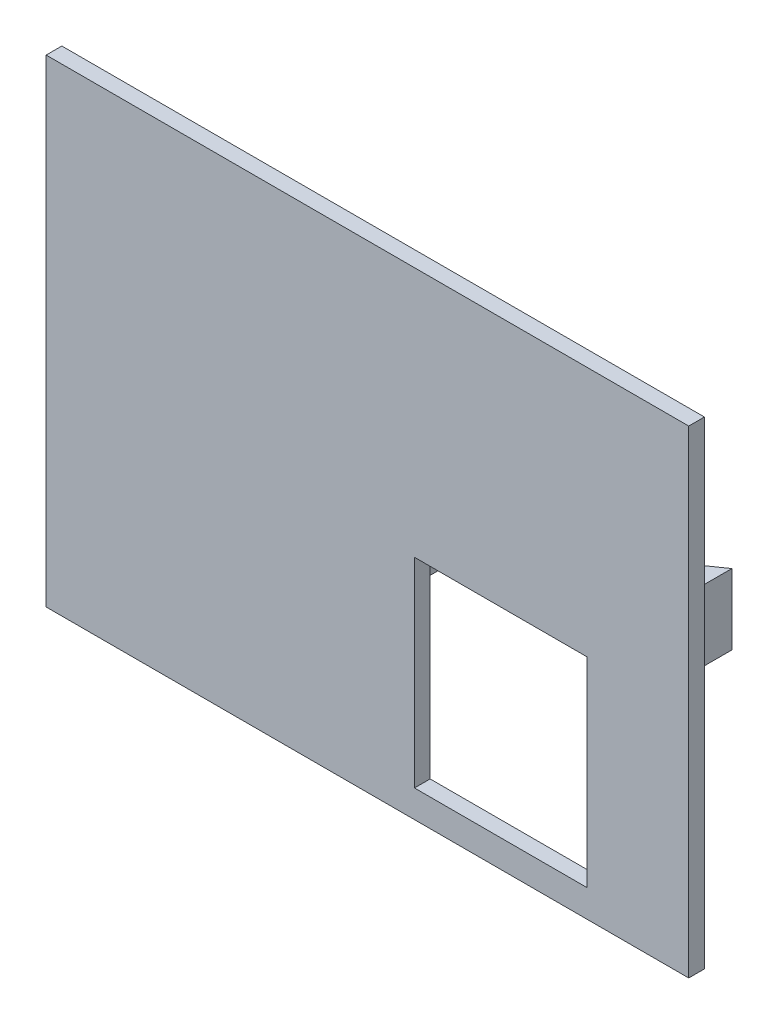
ISO-10303-21;
HEADER;
FILE_DESCRIPTION(('STEP AP214'),'2;1');
FILE_NAME('part.step','',(''),(''),'','','');
FILE_SCHEMA(('AUTOMOTIVE_DESIGN { 1 0 10303 214 1 1 1 1 }'));
ENDSEC;
DATA;
#1=APPLICATION_CONTEXT('core data for automotive mechanical design processes');
#2=APPLICATION_PROTOCOL_DEFINITION('international standard','automotive_design',2000,#1);
#3=PRODUCT_CONTEXT('',#1,'mechanical');
#4=PRODUCT('Part','Part','',(#3));
#5=PRODUCT_RELATED_PRODUCT_CATEGORY('part','',(#4));
#6=PRODUCT_DEFINITION_FORMATION('','',#4);
#7=PRODUCT_DEFINITION_CONTEXT('part definition',#1,'design');
#8=PRODUCT_DEFINITION('design','',#6,#7);
#9=PRODUCT_DEFINITION_SHAPE('','',#8);
#10=(LENGTH_UNIT() NAMED_UNIT(*) SI_UNIT(.MILLI.,.METRE.));
#11=(NAMED_UNIT(*) PLANE_ANGLE_UNIT() SI_UNIT($,.RADIAN.));
#12=(NAMED_UNIT(*) SI_UNIT($,.STERADIAN.) SOLID_ANGLE_UNIT());
#13=UNCERTAINTY_MEASURE_WITH_UNIT(LENGTH_MEASURE(1.E-05),#10,'distance_accuracy_value','');
#14=(GEOMETRIC_REPRESENTATION_CONTEXT(3) GLOBAL_UNCERTAINTY_ASSIGNED_CONTEXT((#13)) GLOBAL_UNIT_ASSIGNED_CONTEXT((#10,
#11,#12)) REPRESENTATION_CONTEXT('',''));
#15=CARTESIAN_POINT('',(0.,0.,0.));
#16=DIRECTION('',(0.,0.,1.));
#17=DIRECTION('',(1.,0.,0.));
#18=AXIS2_PLACEMENT_3D('',#15,#16,#17);
#19=CARTESIAN_POINT('',(-47.3837077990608,-22.5325375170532,0.));
#20=DIRECTION('',(0.,0.,1.));
#21=DIRECTION('',(1.,0.,0.));
#22=AXIS2_PLACEMENT_3D('',#19,#20,#21);
#23=PLANE('',#22);
#24=DIRECTION('',(1.,0.,0.));
#25=VECTOR('',#24,1.);
#26=CARTESIAN_POINT('',(-1.38370779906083,11.4674624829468,0.));
#27=LINE('',#26,#25);
#28=CARTESIAN_POINT('',(-2.88370779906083,11.4674624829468,0.));
#29=VERTEX_POINT('',#28);
#30=CARTESIAN_POINT('',(-1.38370779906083,11.4674624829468,0.));
#31=VERTEX_POINT('',#30);
#32=EDGE_CURVE('E240',#29,#31,#27,.T.);
#33=ORIENTED_EDGE('',*,*,#32,.F.);
#34=DIRECTION('',(0.,1.,0.));
#35=VECTOR('',#34,1.);
#36=CARTESIAN_POINT('',(-2.88370779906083,2.46746248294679,0.));
#37=LINE('',#36,#35);
#38=CARTESIAN_POINT('',(-2.88370779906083,2.46746248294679,0.));
#39=VERTEX_POINT('',#38);
#40=EDGE_CURVE('E234',#39,#29,#37,.T.);
#41=ORIENTED_EDGE('',*,*,#40,.F.);
#42=DIRECTION('',(-1.,0.,0.));
#43=VECTOR('',#42,1.);
#44=CARTESIAN_POINT('',(-1.38370779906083,2.46746248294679,0.));
#45=LINE('',#44,#43);
#46=CARTESIAN_POINT('',(-1.38370779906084,2.46746248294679,0.));
#47=VERTEX_POINT('',#46);
#48=EDGE_CURVE('E246',#47,#39,#45,.T.);
#49=ORIENTED_EDGE('',*,*,#48,.F.);
#50=DIRECTION('',(0.,-1.,0.));
#51=VECTOR('',#50,1.);
#52=CARTESIAN_POINT('',(-1.38370779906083,2.46746248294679,0.));
#53=LINE('',#52,#51);
#54=EDGE_CURVE('E242',#31,#47,#53,.T.);
#55=ORIENTED_EDGE('',*,*,#54,.F.);
#56=EDGE_LOOP('',(#33,#41,#49,#55));
#57=FACE_BOUND('',#56,.T.);
#58=DIRECTION('',(0.,-1.,0.));
#59=VECTOR('',#58,1.);
#60=CARTESIAN_POINT('',(21.6162922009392,-19.0325375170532,0.));
#61=LINE('',#60,#59);
#62=CARTESIAN_POINT('',(21.6162922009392,6.46746248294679,0.));
#63=VERTEX_POINT('',#62);
#64=CARTESIAN_POINT('',(21.6162922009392,-19.0325375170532,0.));
#65=VERTEX_POINT('',#64);
#66=EDGE_CURVE('E270',#63,#65,#61,.T.);
#67=ORIENTED_EDGE('',*,*,#66,.F.);
#68=DIRECTION('',(1.,0.,0.));
#69=VECTOR('',#68,1.);
#70=CARTESIAN_POINT('',(-0.383707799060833,6.46746248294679,0.));
#71=LINE('',#70,#69);
#72=CARTESIAN_POINT('',(-0.383707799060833,6.46746248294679,0.));
#73=VERTEX_POINT('',#72);
#74=EDGE_CURVE('E268',#73,#63,#71,.T.);
#75=ORIENTED_EDGE('',*,*,#74,.F.);
#76=DIRECTION('',(0.,1.,0.));
#77=VECTOR('',#76,1.);
#78=CARTESIAN_POINT('',(-0.383707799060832,-19.0325375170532,0.));
#79=LINE('',#78,#77);
#80=CARTESIAN_POINT('',(-0.383707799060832,-19.0325375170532,0.));
#81=VERTEX_POINT('',#80);
#82=EDGE_CURVE('E258',#81,#73,#79,.T.);
#83=ORIENTED_EDGE('',*,*,#82,.F.);
#84=DIRECTION('',(-1.,0.,0.));
#85=VECTOR('',#84,1.);
#86=CARTESIAN_POINT('',(-0.383707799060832,-19.0325375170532,0.));
#87=LINE('',#86,#85);
#88=EDGE_CURVE('E273',#65,#81,#87,.T.);
#89=ORIENTED_EDGE('',*,*,#88,.F.);
#90=EDGE_LOOP('',(#67,#75,#83,#89));
#91=FACE_BOUND('',#90,.T.);
#92=DIRECTION('',(0.,-1.,0.));
#93=VECTOR('',#92,1.);
#94=CARTESIAN_POINT('',(-47.3837077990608,38.4674624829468,0.));
#95=LINE('',#94,#93);
#96=CARTESIAN_POINT('',(-47.3837077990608,38.4674624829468,0.));
#97=VERTEX_POINT('',#96);
#98=CARTESIAN_POINT('',(-47.3837077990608,-22.5325375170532,0.));
#99=VERTEX_POINT('',#98);
#100=EDGE_CURVE('E280',#97,#99,#95,.T.);
#101=ORIENTED_EDGE('',*,*,#100,.F.);
#102=DIRECTION('',(-1.,0.,0.));
#103=VECTOR('',#102,1.);
#104=CARTESIAN_POINT('',(-47.3837077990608,38.4674624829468,0.));
#105=LINE('',#104,#103);
#106=CARTESIAN_POINT('',(34.6162922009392,38.4674624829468,0.));
#107=VERTEX_POINT('',#106);
#108=EDGE_CURVE('E291',#107,#97,#105,.T.);
#109=ORIENTED_EDGE('',*,*,#108,.F.);
#110=DIRECTION('',(0.,1.,0.));
#111=VECTOR('',#110,1.);
#112=CARTESIAN_POINT('',(34.6162922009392,38.4674624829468,0.));
#113=LINE('',#112,#111);
#114=CARTESIAN_POINT('',(34.6162922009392,-22.5325375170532,0.));
#115=VERTEX_POINT('',#114);
#116=EDGE_CURVE('E302',#115,#107,#113,.T.);
#117=ORIENTED_EDGE('',*,*,#116,.F.);
#118=DIRECTION('',(1.,0.,0.));
#119=VECTOR('',#118,1.);
#120=CARTESIAN_POINT('',(-47.3837077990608,-22.5325375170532,0.));
#121=LINE('',#120,#119);
#122=EDGE_CURVE('E300',#99,#115,#121,.T.);
#123=ORIENTED_EDGE('',*,*,#122,.F.);
#124=EDGE_LOOP('',(#101,#109,#117,#123));
#125=FACE_BOUND('',#124,.T.);
#126=DIRECTION('',(0.,1.,0.));
#127=VECTOR('',#126,1.);
#128=CARTESIAN_POINT('',(24.6162922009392,2.46746248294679,0.));
#129=LINE('',#128,#127);
#130=CARTESIAN_POINT('',(24.6162922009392,2.46746248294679,0.));
#131=VERTEX_POINT('',#130);
#132=CARTESIAN_POINT('',(24.6162922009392,11.4674624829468,0.));
#133=VERTEX_POINT('',#132);
#134=EDGE_CURVE('E195',#131,#133,#129,.T.);
#135=ORIENTED_EDGE('',*,*,#134,.F.);
#136=DIRECTION('',(-1.,0.,0.));
#137=VECTOR('',#136,1.);
#138=CARTESIAN_POINT('',(24.6162922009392,2.46746248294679,0.));
#139=LINE('',#138,#137);
#140=CARTESIAN_POINT('',(26.1162922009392,2.46746248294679,0.));
#141=VERTEX_POINT('',#140);
#142=EDGE_CURVE('E217',#141,#131,#139,.T.);
#143=ORIENTED_EDGE('',*,*,#142,.F.);
#144=DIRECTION('',(0.,-1.,0.));
#145=VECTOR('',#144,1.);
#146=CARTESIAN_POINT('',(26.1162922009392,2.46746248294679,0.));
#147=LINE('',#146,#145);
#148=CARTESIAN_POINT('',(26.1162922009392,11.4674624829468,0.));
#149=VERTEX_POINT('',#148);
#150=EDGE_CURVE('E54',#149,#141,#147,.T.);
#151=ORIENTED_EDGE('',*,*,#150,.F.);
#152=DIRECTION('',(1.,0.,0.));
#153=VECTOR('',#152,1.);
#154=CARTESIAN_POINT('',(24.6162922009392,11.4674624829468,0.));
#155=LINE('',#154,#153);
#156=EDGE_CURVE('E49',#133,#149,#155,.T.);
#157=ORIENTED_EDGE('',*,*,#156,.F.);
#158=EDGE_LOOP('',(#135,#143,#151,#157));
#159=FACE_BOUND('',#158,.T.);
#160=ADVANCED_FACE('F32',(#57,#91,#125,#159),#23,.F.);
#161=CARTESIAN_POINT('',(-47.3837077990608,38.4674624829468,2.));
#162=DIRECTION('',(1.,0.,0.));
#163=DIRECTION('',(0.,0.,-1.));
#164=AXIS2_PLACEMENT_3D('',#161,#162,#163);
#165=PLANE('',#164);
#166=ORIENTED_EDGE('',*,*,#100,.T.);
#167=DIRECTION('',(0.,0.,-1.));
#168=VECTOR('',#167,1.);
#169=CARTESIAN_POINT('',(-47.3837077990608,-22.5325375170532,2.));
#170=LINE('',#169,#168);
#171=CARTESIAN_POINT('',(-47.3837077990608,-22.5325375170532,2.));
#172=VERTEX_POINT('',#171);
#173=EDGE_CURVE('E11',#172,#99,#170,.T.);
#174=ORIENTED_EDGE('',*,*,#173,.F.);
#175=DIRECTION('',(0.,-1.,0.));
#176=VECTOR('',#175,1.);
#177=CARTESIAN_POINT('',(-47.3837077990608,38.4674624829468,2.));
#178=LINE('',#177,#176);
#179=CARTESIAN_POINT('',(-47.3837077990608,38.4674624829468,2.));
#180=VERTEX_POINT('',#179);
#181=EDGE_CURVE('E287',#180,#172,#178,.T.);
#182=ORIENTED_EDGE('',*,*,#181,.F.);
#183=DIRECTION('',(0.,0.,-1.));
#184=VECTOR('',#183,1.);
#185=CARTESIAN_POINT('',(-47.3837077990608,38.4674624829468,2.));
#186=LINE('',#185,#184);
#187=EDGE_CURVE('E297',#180,#97,#186,.T.);
#188=ORIENTED_EDGE('',*,*,#187,.T.);
#189=EDGE_LOOP('',(#166,#174,#182,#188));
#190=FACE_BOUND('',#189,.T.);
#191=ADVANCED_FACE('F34',(#190),#165,.F.);
#192=CARTESIAN_POINT('',(-47.3837077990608,-22.5325375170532,2.));
#193=DIRECTION('',(0.,1.,0.));
#194=DIRECTION('',(0.,0.,1.));
#195=AXIS2_PLACEMENT_3D('',#192,#193,#194);
#196=PLANE('',#195);
#197=ORIENTED_EDGE('',*,*,#122,.T.);
#198=DIRECTION('',(0.,0.,-1.));
#199=VECTOR('',#198,1.);
#200=CARTESIAN_POINT('',(34.6162922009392,-22.5325375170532,2.));
#201=LINE('',#200,#199);
#202=CARTESIAN_POINT('',(34.6162922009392,-22.5325375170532,2.));
#203=VERTEX_POINT('',#202);
#204=EDGE_CURVE('E41',#203,#115,#201,.T.);
#205=ORIENTED_EDGE('',*,*,#204,.F.);
#206=DIRECTION('',(1.,0.,0.));
#207=VECTOR('',#206,1.);
#208=CARTESIAN_POINT('',(-47.3837077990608,-22.5325375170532,2.));
#209=LINE('',#208,#207);
#210=EDGE_CURVE('E290',#172,#203,#209,.T.);
#211=ORIENTED_EDGE('',*,*,#210,.F.);
#212=ORIENTED_EDGE('',*,*,#173,.T.);
#213=EDGE_LOOP('',(#197,#205,#211,#212));
#214=FACE_BOUND('',#213,.T.);
#215=ADVANCED_FACE('F363',(#214),#196,.F.);
#216=CARTESIAN_POINT('',(34.6162922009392,38.4674624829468,2.));
#217=DIRECTION('',(-1.,0.,0.));
#218=DIRECTION('',(0.,-1.,0.));
#219=AXIS2_PLACEMENT_3D('',#216,#217,#218);
#220=PLANE('',#219);
#221=ORIENTED_EDGE('',*,*,#116,.T.);
#222=DIRECTION('',(0.,0.,-1.));
#223=VECTOR('',#222,1.);
#224=CARTESIAN_POINT('',(34.6162922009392,38.4674624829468,2.));
#225=LINE('',#224,#223);
#226=CARTESIAN_POINT('',(34.6162922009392,38.4674624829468,2.));
#227=VERTEX_POINT('',#226);
#228=EDGE_CURVE('E307',#227,#107,#225,.T.);
#229=ORIENTED_EDGE('',*,*,#228,.F.);
#230=DIRECTION('',(0.,1.,0.));
#231=VECTOR('',#230,1.);
#232=CARTESIAN_POINT('',(34.6162922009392,38.4674624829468,2.));
#233=LINE('',#232,#231);
#234=EDGE_CURVE('E293',#203,#227,#233,.T.);
#235=ORIENTED_EDGE('',*,*,#234,.F.);
#236=ORIENTED_EDGE('',*,*,#204,.T.);
#237=EDGE_LOOP('',(#221,#229,#235,#236));
#238=FACE_BOUND('',#237,.T.);
#239=ADVANCED_FACE('F372',(#238),#220,.F.);
#240=CARTESIAN_POINT('',(-47.3837077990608,38.4674624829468,2.));
#241=DIRECTION('',(0.,-1.,0.));
#242=DIRECTION('',(0.,0.,-1.));
#243=AXIS2_PLACEMENT_3D('',#240,#241,#242);
#244=PLANE('',#243);
#245=ORIENTED_EDGE('',*,*,#108,.T.);
#246=ORIENTED_EDGE('',*,*,#187,.F.);
#247=DIRECTION('',(-1.,0.,0.));
#248=VECTOR('',#247,1.);
#249=CARTESIAN_POINT('',(-47.3837077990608,38.4674624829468,2.));
#250=LINE('',#249,#248);
#251=EDGE_CURVE('E295',#227,#180,#250,.T.);
#252=ORIENTED_EDGE('',*,*,#251,.F.);
#253=ORIENTED_EDGE('',*,*,#228,.T.);
#254=EDGE_LOOP('',(#245,#246,#252,#253));
#255=FACE_BOUND('',#254,.T.);
#256=ADVANCED_FACE('F369',(#255),#244,.F.);
#257=CARTESIAN_POINT('',(-47.3837077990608,-22.5325375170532,2.));
#258=DIRECTION('',(0.,0.,1.));
#259=DIRECTION('',(1.,0.,0.));
#260=AXIS2_PLACEMENT_3D('',#257,#258,#259);
#261=PLANE('',#260);
#262=DIRECTION('',(1.,0.,0.));
#263=VECTOR('',#262,1.);
#264=CARTESIAN_POINT('',(-0.383707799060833,6.46746248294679,2.));
#265=LINE('',#264,#263);
#266=CARTESIAN_POINT('',(-0.383707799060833,6.46746248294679,2.));
#267=VERTEX_POINT('',#266);
#268=CARTESIAN_POINT('',(21.6162922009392,6.46746248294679,2.));
#269=VERTEX_POINT('',#268);
#270=EDGE_CURVE('E254',#267,#269,#265,.T.);
#271=ORIENTED_EDGE('',*,*,#270,.T.);
#272=DIRECTION('',(0.,-1.,0.));
#273=VECTOR('',#272,1.);
#274=CARTESIAN_POINT('',(21.6162922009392,-19.0325375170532,2.));
#275=LINE('',#274,#273);
#276=CARTESIAN_POINT('',(21.6162922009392,-19.0325375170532,2.));
#277=VERTEX_POINT('',#276);
#278=EDGE_CURVE('E257',#269,#277,#275,.T.);
#279=ORIENTED_EDGE('',*,*,#278,.T.);
#280=DIRECTION('',(-1.,0.,0.));
#281=VECTOR('',#280,1.);
#282=CARTESIAN_POINT('',(-0.383707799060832,-19.0325375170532,2.));
#283=LINE('',#282,#281);
#284=CARTESIAN_POINT('',(-0.383707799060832,-19.0325375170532,2.));
#285=VERTEX_POINT('',#284);
#286=EDGE_CURVE('E261',#277,#285,#283,.T.);
#287=ORIENTED_EDGE('',*,*,#286,.T.);
#288=DIRECTION('',(0.,1.,0.));
#289=VECTOR('',#288,1.);
#290=CARTESIAN_POINT('',(-0.383707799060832,-19.0325375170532,2.));
#291=LINE('',#290,#289);
#292=EDGE_CURVE('E264',#285,#267,#291,.T.);
#293=ORIENTED_EDGE('',*,*,#292,.T.);
#294=EDGE_LOOP('',(#271,#279,#287,#293));
#295=FACE_BOUND('',#294,.T.);
#296=ORIENTED_EDGE('',*,*,#181,.T.);
#297=ORIENTED_EDGE('',*,*,#210,.T.);
#298=ORIENTED_EDGE('',*,*,#234,.T.);
#299=ORIENTED_EDGE('',*,*,#251,.T.);
#300=EDGE_LOOP('',(#296,#297,#298,#299));
#301=FACE_BOUND('',#300,.T.);
#302=ADVANCED_FACE('F367',(#295,#301),#261,.T.);
#303=CARTESIAN_POINT('',(-0.383707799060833,6.46746248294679,2.));
#304=DIRECTION('',(0.,1.,0.));
#305=DIRECTION('',(-1.,0.,0.));
#306=AXIS2_PLACEMENT_3D('',#303,#304,#305);
#307=PLANE('',#306);
#308=ORIENTED_EDGE('',*,*,#74,.T.);
#309=DIRECTION('',(0.,0.,-1.));
#310=VECTOR('',#309,1.);
#311=CARTESIAN_POINT('',(21.6162922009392,6.46746248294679,2.));
#312=LINE('',#311,#310);
#313=EDGE_CURVE('E267',#269,#63,#312,.T.);
#314=ORIENTED_EDGE('',*,*,#313,.F.);
#315=ORIENTED_EDGE('',*,*,#270,.F.);
#316=DIRECTION('',(0.,0.,-1.));
#317=VECTOR('',#316,1.);
#318=CARTESIAN_POINT('',(-0.383707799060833,6.46746248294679,2.));
#319=LINE('',#318,#317);
#320=EDGE_CURVE('E278',#267,#73,#319,.T.);
#321=ORIENTED_EDGE('',*,*,#320,.T.);
#322=EDGE_LOOP('',(#308,#314,#315,#321));
#323=FACE_BOUND('',#322,.T.);
#324=ADVANCED_FACE('F393',(#323),#307,.F.);
#325=CARTESIAN_POINT('',(-0.383707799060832,-19.0325375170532,2.));
#326=DIRECTION('',(-1.,0.,0.));
#327=DIRECTION('',(0.,-1.,0.));
#328=AXIS2_PLACEMENT_3D('',#325,#326,#327);
#329=PLANE('',#328);
#330=ORIENTED_EDGE('',*,*,#82,.T.);
#331=ORIENTED_EDGE('',*,*,#320,.F.);
#332=ORIENTED_EDGE('',*,*,#292,.F.);
#333=DIRECTION('',(0.,0.,-1.));
#334=VECTOR('',#333,1.);
#335=CARTESIAN_POINT('',(-0.383707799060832,-19.0325375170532,2.));
#336=LINE('',#335,#334);
#337=EDGE_CURVE('E281',#285,#81,#336,.T.);
#338=ORIENTED_EDGE('',*,*,#337,.T.);
#339=EDGE_LOOP('',(#330,#331,#332,#338));
#340=FACE_BOUND('',#339,.T.);
#341=ADVANCED_FACE('F398',(#340),#329,.F.);
#342=CARTESIAN_POINT('',(-0.383707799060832,-19.0325375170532,2.));
#343=DIRECTION('',(0.,-1.,0.));
#344=DIRECTION('',(0.,0.,-1.));
#345=AXIS2_PLACEMENT_3D('',#342,#343,#344);
#346=PLANE('',#345);
#347=ORIENTED_EDGE('',*,*,#88,.T.);
#348=ORIENTED_EDGE('',*,*,#337,.F.);
#349=ORIENTED_EDGE('',*,*,#286,.F.);
#350=DIRECTION('',(0.,0.,-1.));
#351=VECTOR('',#350,1.);
#352=CARTESIAN_POINT('',(21.6162922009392,-19.0325375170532,2.));
#353=LINE('',#352,#351);
#354=EDGE_CURVE('E283',#277,#65,#353,.T.);
#355=ORIENTED_EDGE('',*,*,#354,.T.);
#356=EDGE_LOOP('',(#347,#348,#349,#355));
#357=FACE_BOUND('',#356,.T.);
#358=ADVANCED_FACE('F409',(#357),#346,.F.);
#359=CARTESIAN_POINT('',(21.6162922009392,-19.0325375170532,2.));
#360=DIRECTION('',(1.,0.,0.));
#361=DIRECTION('',(0.,0.,-1.));
#362=AXIS2_PLACEMENT_3D('',#359,#360,#361);
#363=PLANE('',#362);
#364=ORIENTED_EDGE('',*,*,#66,.T.);
#365=ORIENTED_EDGE('',*,*,#354,.F.);
#366=ORIENTED_EDGE('',*,*,#278,.F.);
#367=ORIENTED_EDGE('',*,*,#313,.T.);
#368=EDGE_LOOP('',(#364,#365,#366,#367));
#369=FACE_BOUND('',#368,.T.);
#370=ADVANCED_FACE('F356',(#369),#363,.F.);
#371=CARTESIAN_POINT('',(-1.38370779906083,11.4674624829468,-9.));
#372=DIRECTION('',(0.,-1.,0.));
#373=DIRECTION('',(0.,0.,-1.));
#374=AXIS2_PLACEMENT_3D('',#371,#372,#373);
#375=PLANE('',#374);
#376=DIRECTION('',(1.,0.,0.));
#377=VECTOR('',#376,1.);
#378=CARTESIAN_POINT('',(-2.88370779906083,11.4674624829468,-9.));
#379=LINE('',#378,#377);
#380=CARTESIAN_POINT('',(-1.38370779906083,11.4674624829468,-9.));
#381=VERTEX_POINT('',#380);
#382=CARTESIAN_POINT('',(1.41629220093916,11.4674624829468,-9.));
#383=VERTEX_POINT('',#382);
#384=EDGE_CURVE('E172',#381,#383,#379,.T.);
#385=ORIENTED_EDGE('',*,*,#384,.T.);
#386=DIRECTION('',(-0.820126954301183,0.,-0.572181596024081));
#387=VECTOR('',#386,1.);
#388=CARTESIAN_POINT('',(1.41629220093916,11.4674624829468,-9.));
#389=LINE('',#388,#387);
#390=CARTESIAN_POINT('',(-2.88370779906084,11.4674624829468,-12.));
#391=VERTEX_POINT('',#390);
#392=EDGE_CURVE('E156',#383,#391,#389,.T.);
#393=ORIENTED_EDGE('',*,*,#392,.T.);
#394=DIRECTION('',(0.,0.,1.));
#395=VECTOR('',#394,1.);
#396=CARTESIAN_POINT('',(-2.88370779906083,11.4674624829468,-9.));
#397=LINE('',#396,#395);
#398=EDGE_CURVE('E233',#391,#29,#397,.T.);
#399=ORIENTED_EDGE('',*,*,#398,.T.);
#400=ORIENTED_EDGE('',*,*,#32,.T.);
#401=DIRECTION('',(0.,0.,1.));
#402=VECTOR('',#401,1.);
#403=CARTESIAN_POINT('',(-1.38370779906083,11.4674624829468,-9.));
#404=LINE('',#403,#402);
#405=EDGE_CURVE('E176',#381,#31,#404,.T.);
#406=ORIENTED_EDGE('',*,*,#405,.F.);
#407=EDGE_LOOP('',(#385,#393,#399,#400,#406));
#408=FACE_BOUND('',#407,.T.);
#409=ADVANCED_FACE('F173',(#408),#375,.F.);
#410=CARTESIAN_POINT('',(-1.38370779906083,2.46746248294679,-9.));
#411=DIRECTION('',(-1.,0.,0.));
#412=DIRECTION('',(0.,0.,1.));
#413=AXIS2_PLACEMENT_3D('',#410,#411,#412);
#414=PLANE('',#413);
#415=ORIENTED_EDGE('',*,*,#54,.T.);
#416=DIRECTION('',(0.,0.,1.));
#417=VECTOR('',#416,1.);
#418=CARTESIAN_POINT('',(-1.38370779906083,2.46746248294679,-9.));
#419=LINE('',#418,#417);
#420=CARTESIAN_POINT('',(-1.38370779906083,2.46746248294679,-9.));
#421=VERTEX_POINT('',#420);
#422=EDGE_CURVE('E225',#421,#47,#419,.T.);
#423=ORIENTED_EDGE('',*,*,#422,.F.);
#424=DIRECTION('',(0.,-1.,0.));
#425=VECTOR('',#424,1.);
#426=CARTESIAN_POINT('',(-1.38370779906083,2.46746248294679,-9.));
#427=LINE('',#426,#425);
#428=EDGE_CURVE('E231',#381,#421,#427,.T.);
#429=ORIENTED_EDGE('',*,*,#428,.F.);
#430=ORIENTED_EDGE('',*,*,#405,.T.);
#431=EDGE_LOOP('',(#415,#423,#429,#430));
#432=FACE_BOUND('',#431,.T.);
#433=ADVANCED_FACE('F348',(#432),#414,.F.);
#434=CARTESIAN_POINT('',(-1.38370779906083,2.46746248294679,-9.));
#435=DIRECTION('',(0.,1.,0.));
#436=DIRECTION('',(0.,0.,1.));
#437=AXIS2_PLACEMENT_3D('',#434,#435,#436);
#438=PLANE('',#437);
#439=DIRECTION('',(0.,0.,1.));
#440=VECTOR('',#439,1.);
#441=CARTESIAN_POINT('',(-2.88370779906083,2.46746248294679,-9.));
#442=LINE('',#441,#440);
#443=CARTESIAN_POINT('',(-2.88370779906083,2.46746248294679,-12.));
#444=VERTEX_POINT('',#443);
#445=EDGE_CURVE('E228',#444,#39,#442,.T.);
#446=ORIENTED_EDGE('',*,*,#445,.F.);
#447=DIRECTION('',(-0.820126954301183,0.,-0.572181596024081));
#448=VECTOR('',#447,1.);
#449=CARTESIAN_POINT('',(1.41629220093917,2.46746248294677,-9.));
#450=LINE('',#449,#448);
#451=CARTESIAN_POINT('',(1.41629220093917,2.46746248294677,-9.));
#452=VERTEX_POINT('',#451);
#453=EDGE_CURVE('E168',#452,#444,#450,.T.);
#454=ORIENTED_EDGE('',*,*,#453,.F.);
#455=DIRECTION('',(-1.,0.,0.));
#456=VECTOR('',#455,1.);
#457=CARTESIAN_POINT('',(-2.88370779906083,2.46746248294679,-9.));
#458=LINE('',#457,#456);
#459=EDGE_CURVE('E184',#452,#421,#458,.T.);
#460=ORIENTED_EDGE('',*,*,#459,.T.);
#461=ORIENTED_EDGE('',*,*,#422,.T.);
#462=ORIENTED_EDGE('',*,*,#48,.T.);
#463=EDGE_LOOP('',(#446,#454,#460,#461,#462));
#464=FACE_BOUND('',#463,.T.);
#465=ADVANCED_FACE('F342',(#464),#438,.F.);
#466=CARTESIAN_POINT('',(-2.88370779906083,2.46746248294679,-9.));
#467=DIRECTION('',(1.,0.,0.));
#468=DIRECTION('',(0.,0.,-1.));
#469=AXIS2_PLACEMENT_3D('',#466,#467,#468);
#470=PLANE('',#469);
#471=ORIENTED_EDGE('',*,*,#40,.T.);
#472=ORIENTED_EDGE('',*,*,#398,.F.);
#473=DIRECTION('',(0.,1.,0.));
#474=VECTOR('',#473,1.);
#475=CARTESIAN_POINT('',(-2.88370779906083,11.4674624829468,-12.));
#476=LINE('',#475,#474);
#477=EDGE_CURVE('E163',#444,#391,#476,.T.);
#478=ORIENTED_EDGE('',*,*,#477,.F.);
#479=ORIENTED_EDGE('',*,*,#445,.T.);
#480=EDGE_LOOP('',(#471,#472,#478,#479));
#481=FACE_BOUND('',#480,.T.);
#482=ADVANCED_FACE('F344',(#481),#470,.F.);
#483=CARTESIAN_POINT('',(24.6162922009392,2.46746248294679,-9.));
#484=DIRECTION('',(1.,0.,0.));
#485=DIRECTION('',(0.,0.,-1.));
#486=AXIS2_PLACEMENT_3D('',#483,#484,#485);
#487=PLANE('',#486);
#488=ORIENTED_EDGE('',*,*,#134,.T.);
#489=DIRECTION('',(0.,0.,1.));
#490=VECTOR('',#489,1.);
#491=CARTESIAN_POINT('',(24.6162922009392,11.4674624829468,-9.));
#492=LINE('',#491,#490);
#493=CARTESIAN_POINT('',(24.6162922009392,11.4674624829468,-9.));
#494=VERTEX_POINT('',#493);
#495=EDGE_CURVE('E243',#494,#133,#492,.T.);
#496=ORIENTED_EDGE('',*,*,#495,.F.);
#497=DIRECTION('',(0.,1.,0.));
#498=VECTOR('',#497,1.);
#499=CARTESIAN_POINT('',(24.6162922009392,2.46746248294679,-9.));
#500=LINE('',#499,#498);
#501=CARTESIAN_POINT('',(24.6162922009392,2.46746248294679,-9.));
#502=VERTEX_POINT('',#501);
#503=EDGE_CURVE('E212',#502,#494,#500,.T.);
#504=ORIENTED_EDGE('',*,*,#503,.F.);
#505=DIRECTION('',(0.,0.,1.));
#506=VECTOR('',#505,1.);
#507=CARTESIAN_POINT('',(24.6162922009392,2.46746248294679,-9.));
#508=LINE('',#507,#506);
#509=EDGE_CURVE('E216',#502,#131,#508,.T.);
#510=ORIENTED_EDGE('',*,*,#509,.T.);
#511=EDGE_LOOP('',(#488,#496,#504,#510));
#512=FACE_BOUND('',#511,.T.);
#513=ADVANCED_FACE('F325',(#512),#487,.F.);
#514=CARTESIAN_POINT('',(24.6162922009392,11.4674624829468,-9.));
#515=DIRECTION('',(0.,-1.,0.));
#516=DIRECTION('',(0.,0.,-1.));
#517=AXIS2_PLACEMENT_3D('',#514,#515,#516);
#518=PLANE('',#517);
#519=DIRECTION('',(0.,0.,1.));
#520=VECTOR('',#519,1.);
#521=CARTESIAN_POINT('',(26.1162922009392,11.4674624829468,-9.));
#522=LINE('',#521,#520);
#523=CARTESIAN_POINT('',(26.1162922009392,11.4674624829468,-12.));
#524=VERTEX_POINT('',#523);
#525=EDGE_CURVE('E238',#524,#149,#522,.T.);
#526=ORIENTED_EDGE('',*,*,#525,.F.);
#527=DIRECTION('',(-0.820126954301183,0.,0.572181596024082));
#528=VECTOR('',#527,1.);
#529=CARTESIAN_POINT('',(26.1162922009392,11.4674624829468,-12.));
#530=LINE('',#529,#528);
#531=CARTESIAN_POINT('',(21.8162922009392,11.4674624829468,-9.));
#532=VERTEX_POINT('',#531);
#533=EDGE_CURVE('E179',#524,#532,#530,.T.);
#534=ORIENTED_EDGE('',*,*,#533,.T.);
#535=DIRECTION('',(1.,0.,0.));
#536=VECTOR('',#535,1.);
#537=CARTESIAN_POINT('',(26.1162922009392,11.4674624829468,-9.));
#538=LINE('',#537,#536);
#539=EDGE_CURVE('E202',#532,#494,#538,.T.);
#540=ORIENTED_EDGE('',*,*,#539,.T.);
#541=ORIENTED_EDGE('',*,*,#495,.T.);
#542=ORIENTED_EDGE('',*,*,#156,.T.);
#543=EDGE_LOOP('',(#526,#534,#540,#541,#542));
#544=FACE_BOUND('',#543,.T.);
#545=ADVANCED_FACE('F336',(#544),#518,.F.);
#546=CARTESIAN_POINT('',(26.1162922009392,2.46746248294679,-9.));
#547=DIRECTION('',(-1.,0.,0.));
#548=DIRECTION('',(0.,0.,1.));
#549=AXIS2_PLACEMENT_3D('',#546,#547,#548);
#550=PLANE('',#549);
#551=ORIENTED_EDGE('',*,*,#150,.T.);
#552=DIRECTION('',(0.,0.,1.));
#553=VECTOR('',#552,1.);
#554=CARTESIAN_POINT('',(26.1162922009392,2.46746248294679,-9.));
#555=LINE('',#554,#553);
#556=CARTESIAN_POINT('',(26.1162922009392,2.46746248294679,-12.));
#557=VERTEX_POINT('',#556);
#558=EDGE_CURVE('E222',#557,#141,#555,.T.);
#559=ORIENTED_EDGE('',*,*,#558,.F.);
#560=DIRECTION('',(0.,-1.,0.));
#561=VECTOR('',#560,1.);
#562=CARTESIAN_POINT('',(26.1162922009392,11.4674624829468,-12.));
#563=LINE('',#562,#561);
#564=EDGE_CURVE('E193',#524,#557,#563,.T.);
#565=ORIENTED_EDGE('',*,*,#564,.F.);
#566=ORIENTED_EDGE('',*,*,#525,.T.);
#567=EDGE_LOOP('',(#551,#559,#565,#566));
#568=FACE_BOUND('',#567,.T.);
#569=ADVANCED_FACE('F459',(#568),#550,.F.);
#570=CARTESIAN_POINT('',(24.6162922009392,2.46746248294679,-9.));
#571=DIRECTION('',(0.,1.,0.));
#572=DIRECTION('',(-1.,0.,0.));
#573=AXIS2_PLACEMENT_3D('',#570,#571,#572);
#574=PLANE('',#573);
#575=DIRECTION('',(-1.,0.,0.));
#576=VECTOR('',#575,1.);
#577=CARTESIAN_POINT('',(26.1162922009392,2.46746248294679,-9.));
#578=LINE('',#577,#576);
#579=CARTESIAN_POINT('',(21.8162922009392,2.46746248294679,-9.));
#580=VERTEX_POINT('',#579);
#581=EDGE_CURVE('E205',#502,#580,#578,.T.);
#582=ORIENTED_EDGE('',*,*,#581,.T.);
#583=DIRECTION('',(-0.820126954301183,0.,0.572181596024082));
#584=VECTOR('',#583,1.);
#585=CARTESIAN_POINT('',(26.1162922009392,2.46746248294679,-12.));
#586=LINE('',#585,#584);
#587=EDGE_CURVE('E167',#557,#580,#586,.T.);
#588=ORIENTED_EDGE('',*,*,#587,.F.);
#589=ORIENTED_EDGE('',*,*,#558,.T.);
#590=ORIENTED_EDGE('',*,*,#142,.T.);
#591=ORIENTED_EDGE('',*,*,#509,.F.);
#592=EDGE_LOOP('',(#582,#588,#589,#590,#591));
#593=FACE_BOUND('',#592,.T.);
#594=ADVANCED_FACE('F327',(#593),#574,.F.);
#595=CARTESIAN_POINT('',(21.8162922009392,11.4674624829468,-9.));
#596=DIRECTION('',(0.,0.,1.));
#597=DIRECTION('',(1.,0.,0.));
#598=AXIS2_PLACEMENT_3D('',#595,#596,#597);
#599=PLANE('',#598);
#600=ORIENTED_EDGE('',*,*,#581,.F.);
#601=ORIENTED_EDGE('',*,*,#503,.T.);
#602=ORIENTED_EDGE('',*,*,#539,.F.);
#603=DIRECTION('',(0.,1.,0.));
#604=VECTOR('',#603,1.);
#605=CARTESIAN_POINT('',(21.8162922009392,11.4674624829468,-9.));
#606=LINE('',#605,#604);
#607=EDGE_CURVE('E196',#580,#532,#606,.T.);
#608=ORIENTED_EDGE('',*,*,#607,.F.);
#609=EDGE_LOOP('',(#600,#601,#602,#608));
#610=FACE_BOUND('',#609,.T.);
#611=ADVANCED_FACE('F332',(#610),#599,.T.);
#612=CARTESIAN_POINT('',(1.41629220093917,11.4674624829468,-9.));
#613=DIRECTION('',(0.,0.,-1.));
#614=DIRECTION('',(-1.,0.,0.));
#615=AXIS2_PLACEMENT_3D('',#612,#613,#614);
#616=PLANE('',#615);
#617=ORIENTED_EDGE('',*,*,#384,.F.);
#618=ORIENTED_EDGE('',*,*,#428,.T.);
#619=ORIENTED_EDGE('',*,*,#459,.F.);
#620=DIRECTION('',(0.,-1.,0.));
#621=VECTOR('',#620,1.);
#622=CARTESIAN_POINT('',(1.41629220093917,11.4674624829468,-9.));
#623=LINE('',#622,#621);
#624=EDGE_CURVE('E160',#383,#452,#623,.T.);
#625=ORIENTED_EDGE('',*,*,#624,.F.);
#626=EDGE_LOOP('',(#617,#618,#619,#625));
#627=FACE_BOUND('',#626,.T.);
#628=ADVANCED_FACE('F182',(#627),#616,.F.);
#629=CARTESIAN_POINT('',(26.1162922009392,11.4674624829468,-12.));
#630=DIRECTION('',(0.572181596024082,0.,0.820126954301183));
#631=DIRECTION('',(0.820126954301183,0.,-0.572181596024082));
#632=AXIS2_PLACEMENT_3D('',#629,#630,#631);
#633=PLANE('',#632);
#634=ORIENTED_EDGE('',*,*,#587,.T.);
#635=ORIENTED_EDGE('',*,*,#607,.T.);
#636=ORIENTED_EDGE('',*,*,#533,.F.);
#637=ORIENTED_EDGE('',*,*,#564,.T.);
#638=EDGE_LOOP('',(#634,#635,#636,#637));
#639=FACE_BOUND('',#638,.T.);
#640=ADVANCED_FACE('F335',(#639),#633,.F.);
#641=CARTESIAN_POINT('',(1.41629220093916,11.4674624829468,-9.));
#642=DIRECTION('',(-0.572181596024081,0.,0.820126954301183));
#643=DIRECTION('',(0.820126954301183,0.,0.572181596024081));
#644=AXIS2_PLACEMENT_3D('',#641,#642,#643);
#645=PLANE('',#644);
#646=ORIENTED_EDGE('',*,*,#453,.T.);
#647=ORIENTED_EDGE('',*,*,#477,.T.);
#648=ORIENTED_EDGE('',*,*,#392,.F.);
#649=ORIENTED_EDGE('',*,*,#624,.T.);
#650=EDGE_LOOP('',(#646,#647,#648,#649));
#651=FACE_BOUND('',#650,.T.);
#652=ADVANCED_FACE('F158',(#651),#645,.F.);
#653=CLOSED_SHELL('',(#160,#191,#215,#239,#256,#302,#324,#341,#358,#370,#409,#433,#465,#482,
#513,#545,#569,#594,#611,#628,#640,#652));
#654=MANIFOLD_SOLID_BREP('B2',#653);
#655=ADVANCED_BREP_SHAPE_REPRESENTATION('',(#18,#654),#14);
#656=SHAPE_DEFINITION_REPRESENTATION(#9,#655);
ENDSEC;
END-ISO-10303-21;
